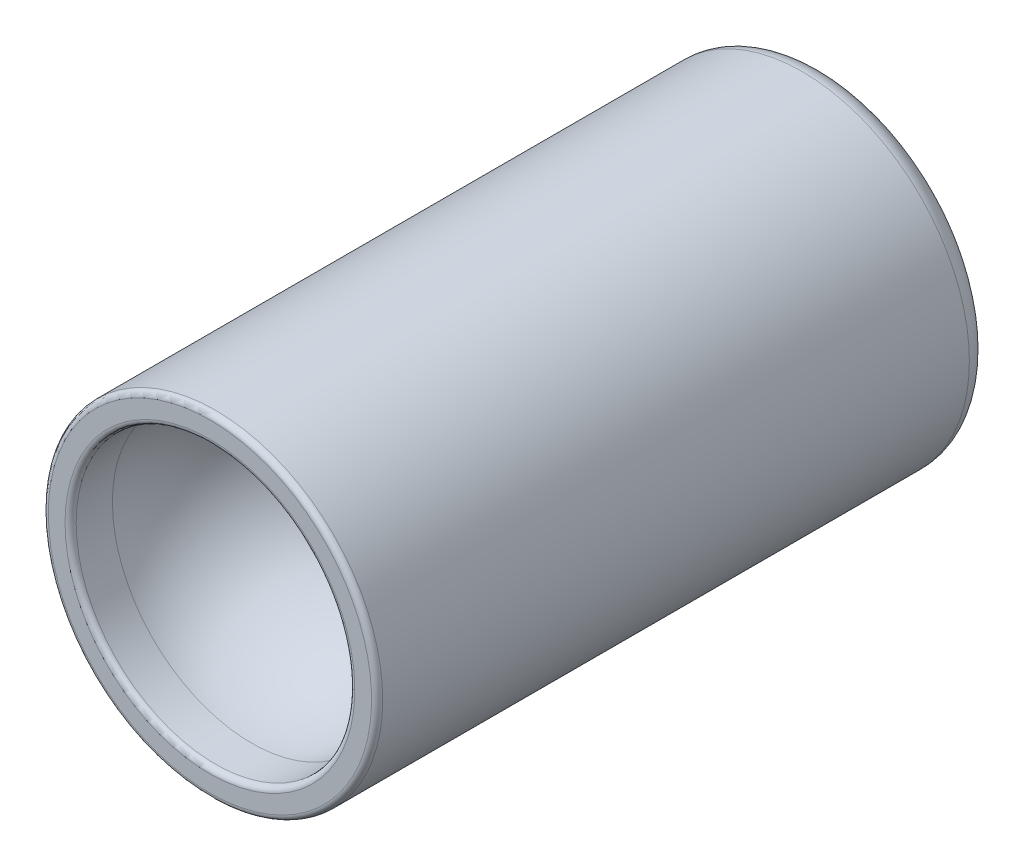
ISO-10303-21;
HEADER;
FILE_DESCRIPTION(('STEP AP214'),'2;1');
FILE_NAME('part.step','',(''),(''),'','','');
FILE_SCHEMA(('AUTOMOTIVE_DESIGN { 1 0 10303 214 1 1 1 1 }'));
ENDSEC;
DATA;
#1=APPLICATION_CONTEXT('core data for automotive mechanical design processes');
#2=APPLICATION_PROTOCOL_DEFINITION('international standard','automotive_design',2000,#1);
#3=PRODUCT_CONTEXT('',#1,'mechanical');
#4=PRODUCT('Part','Part','',(#3));
#5=PRODUCT_RELATED_PRODUCT_CATEGORY('part','',(#4));
#6=PRODUCT_DEFINITION_FORMATION('','',#4);
#7=PRODUCT_DEFINITION_CONTEXT('part definition',#1,'design');
#8=PRODUCT_DEFINITION('design','',#6,#7);
#9=PRODUCT_DEFINITION_SHAPE('','',#8);
#10=(LENGTH_UNIT() NAMED_UNIT(*) SI_UNIT(.MILLI.,.METRE.));
#11=(NAMED_UNIT(*) PLANE_ANGLE_UNIT() SI_UNIT($,.RADIAN.));
#12=(NAMED_UNIT(*) SI_UNIT($,.STERADIAN.) SOLID_ANGLE_UNIT());
#13=UNCERTAINTY_MEASURE_WITH_UNIT(LENGTH_MEASURE(1.E-05),#10,'distance_accuracy_value','');
#14=(GEOMETRIC_REPRESENTATION_CONTEXT(3) GLOBAL_UNCERTAINTY_ASSIGNED_CONTEXT((#13)) GLOBAL_UNIT_ASSIGNED_CONTEXT((#10,
#11,#12)) REPRESENTATION_CONTEXT('',''));
#15=CARTESIAN_POINT('',(0.,0.,0.));
#16=DIRECTION('',(0.,0.,1.));
#17=DIRECTION('',(1.,0.,0.));
#18=AXIS2_PLACEMENT_3D('',#15,#16,#17);
#19=CARTESIAN_POINT('',(0.,6.,0.));
#20=DIRECTION('',(0.,0.,-1.));
#21=DIRECTION('',(-1.,0.,0.));
#22=AXIS2_PLACEMENT_3D('',#19,#20,#21);
#23=PLANE('',#22);
#24=CARTESIAN_POINT('',(0.,0.,0.));
#25=DIRECTION('',(0.,0.,-1.));
#26=DIRECTION('',(-1.,0.,0.));
#27=AXIS2_PLACEMENT_3D('',#24,#25,#26);
#28=CIRCLE('',#27,5.2);
#29=CARTESIAN_POINT('',(-5.2,0.,0.));
#30=VERTEX_POINT('',#29);
#31=EDGE_CURVE('E43',#30,#30,#28,.T.);
#32=ORIENTED_EDGE('',*,*,#31,.T.);
#33=EDGE_LOOP('',(#32));
#34=FACE_BOUND('',#33,.T.);
#35=CARTESIAN_POINT('',(0.,0.,0.));
#36=DIRECTION('',(0.,0.,-1.));
#37=DIRECTION('',(-1.,0.,0.));
#38=AXIS2_PLACEMENT_3D('',#35,#36,#37);
#39=CIRCLE('',#38,5.8);
#40=CARTESIAN_POINT('',(-5.8,0.,0.));
#41=VERTEX_POINT('',#40);
#42=EDGE_CURVE('E46',#41,#41,#39,.F.);
#43=ORIENTED_EDGE('',*,*,#42,.T.);
#44=EDGE_LOOP('',(#43));
#45=FACE_BOUND('',#44,.T.);
#46=ADVANCED_FACE('F24',(#34,#45),#23,.F.);
#47=CARTESIAN_POINT('',(0.,0.,0.));
#48=DIRECTION('',(0.,0.,1.));
#49=DIRECTION('',(1.,0.,0.));
#50=AXIS2_PLACEMENT_3D('',#47,#48,#49);
#51=CYLINDRICAL_SURFACE('',#50,5.);
#52=CARTESIAN_POINT('',(0.,0.,-0.2));
#53=DIRECTION('',(0.,0.,-1.));
#54=DIRECTION('',(-1.,0.,0.));
#55=AXIS2_PLACEMENT_3D('',#52,#53,#54);
#56=CIRCLE('',#55,5.);
#57=CARTESIAN_POINT('',(-5.,0.,-0.2));
#58=VERTEX_POINT('',#57);
#59=EDGE_CURVE('E49',#58,#58,#56,.F.);
#60=ORIENTED_EDGE('',*,*,#59,.T.);
#61=EDGE_LOOP('',(#60));
#62=FACE_BOUND('',#61,.T.);
#63=CARTESIAN_POINT('',(0.,0.,-1.5));
#64=DIRECTION('',(0.,0.,1.));
#65=DIRECTION('',(1.,0.,0.));
#66=AXIS2_PLACEMENT_3D('',#63,#64,#65);
#67=CIRCLE('',#66,5.);
#68=CARTESIAN_POINT('',(5.,0.,-1.5));
#69=VERTEX_POINT('',#68);
#70=EDGE_CURVE('E61',#69,#69,#67,.T.);
#71=ORIENTED_EDGE('',*,*,#70,.F.);
#72=EDGE_LOOP('',(#71));
#73=FACE_BOUND('',#72,.T.);
#74=ADVANCED_FACE('F94',(#62,#73),#51,.F.);
#75=CARTESIAN_POINT('',(0.,0.,-1.5));
#76=DIRECTION('',(0.,0.,1.));
#77=DIRECTION('',(0.,1.,0.));
#78=AXIS2_PLACEMENT_3D('',#75,#76,#77);
#79=SPHERICAL_SURFACE('',#78,5.);
#80=CARTESIAN_POINT('',(0.,0.,-5.61752954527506));
#81=DIRECTION('',(0.,0.,1.));
#82=DIRECTION('',(1.,0.,0.));
#83=AXIS2_PLACEMENT_3D('',#80,#81,#82);
#84=CIRCLE('',#83,2.83653846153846);
#85=CARTESIAN_POINT('',(2.83653846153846,0.,-5.61752954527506));
#86=VERTEX_POINT('',#85);
#87=EDGE_CURVE('E52',#86,#86,#84,.F.);
#88=ORIENTED_EDGE('',*,*,#87,.T.);
#89=EDGE_LOOP('',(#88));
#90=FACE_BOUND('',#89,.T.);
#91=ORIENTED_EDGE('',*,*,#70,.T.);
#92=EDGE_LOOP('',(#91));
#93=FACE_BOUND('',#92,.T.);
#94=ADVANCED_FACE('F99',(#90,#93),#79,.F.);
#95=CARTESIAN_POINT('',(0.,0.,0.));
#96=DIRECTION('',(0.,0.,1.));
#97=DIRECTION('',(1.,0.,0.));
#98=AXIS2_PLACEMENT_3D('',#95,#96,#97);
#99=CYLINDRICAL_SURFACE('',#98,2.75);
#100=CARTESIAN_POINT('',(0.,0.,-5.78223072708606));
#101=DIRECTION('',(0.,0.,1.));
#102=DIRECTION('',(1.,0.,0.));
#103=AXIS2_PLACEMENT_3D('',#100,#101,#102);
#104=CIRCLE('',#103,2.75);
#105=CARTESIAN_POINT('',(2.75,0.,-5.78223072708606));
#106=VERTEX_POINT('',#105);
#107=EDGE_CURVE('E55',#106,#106,#104,.T.);
#108=ORIENTED_EDGE('',*,*,#107,.T.);
#109=EDGE_LOOP('',(#108));
#110=FACE_BOUND('',#109,.T.);
#111=CARTESIAN_POINT('',(0.,0.,-12.2177692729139));
#112=DIRECTION('',(0.,0.,-1.));
#113=DIRECTION('',(-1.,0.,0.));
#114=AXIS2_PLACEMENT_3D('',#111,#112,#113);
#115=CIRCLE('',#114,2.75);
#116=CARTESIAN_POINT('',(-2.75,0.,-12.2177692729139));
#117=VERTEX_POINT('',#116);
#118=EDGE_CURVE('E58',#117,#117,#115,.T.);
#119=ORIENTED_EDGE('',*,*,#118,.T.);
#120=EDGE_LOOP('',(#119));
#121=FACE_BOUND('',#120,.T.);
#122=ADVANCED_FACE('F165',(#110,#121),#99,.F.);
#123=CARTESIAN_POINT('',(0.,0.,-16.5));
#124=DIRECTION('',(0.,0.,1.));
#125=DIRECTION('',(0.,1.,0.));
#126=AXIS2_PLACEMENT_3D('',#123,#124,#125);
#127=SPHERICAL_SURFACE('',#126,5.);
#128=CARTESIAN_POINT('',(0.,0.,-12.3824704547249));
#129=DIRECTION('',(0.,0.,-1.));
#130=DIRECTION('',(-1.,0.,0.));
#131=AXIS2_PLACEMENT_3D('',#128,#129,#130);
#132=CIRCLE('',#131,2.83653846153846);
#133=CARTESIAN_POINT('',(-2.83653846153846,0.,-12.3824704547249));
#134=VERTEX_POINT('',#133);
#135=EDGE_CURVE('E38',#134,#134,#132,.F.);
#136=ORIENTED_EDGE('',*,*,#135,.T.);
#137=EDGE_LOOP('',(#136));
#138=FACE_BOUND('',#137,.T.);
#139=CARTESIAN_POINT('',(0.,0.,-16.5));
#140=DIRECTION('',(0.,0.,1.));
#141=DIRECTION('',(1.,0.,0.));
#142=AXIS2_PLACEMENT_3D('',#139,#140,#141);
#143=CIRCLE('',#142,5.);
#144=CARTESIAN_POINT('',(5.,0.,-16.5));
#145=VERTEX_POINT('',#144);
#146=EDGE_CURVE('E64',#145,#145,#143,.T.);
#147=ORIENTED_EDGE('',*,*,#146,.F.);
#148=EDGE_LOOP('',(#147));
#149=FACE_BOUND('',#148,.T.);
#150=ADVANCED_FACE('F91',(#138,#149),#127,.F.);
#151=CARTESIAN_POINT('',(0.,0.,0.));
#152=DIRECTION('',(0.,0.,1.));
#153=DIRECTION('',(1.,0.,0.));
#154=AXIS2_PLACEMENT_3D('',#151,#152,#153);
#155=CYLINDRICAL_SURFACE('',#154,5.);
#156=CARTESIAN_POINT('',(0.,0.,-21.8));
#157=DIRECTION('',(0.,0.,1.));
#158=DIRECTION('',(1.,0.,0.));
#159=AXIS2_PLACEMENT_3D('',#156,#157,#158);
#160=CIRCLE('',#159,5.);
#161=CARTESIAN_POINT('',(5.,0.,-21.8));
#162=VERTEX_POINT('',#161);
#163=EDGE_CURVE('E30',#162,#162,#160,.F.);
#164=ORIENTED_EDGE('',*,*,#163,.T.);
#165=EDGE_LOOP('',(#164));
#166=FACE_BOUND('',#165,.T.);
#167=ORIENTED_EDGE('',*,*,#146,.T.);
#168=EDGE_LOOP('',(#167));
#169=FACE_BOUND('',#168,.T.);
#170=ADVANCED_FACE('F84',(#166,#169),#155,.F.);
#171=CARTESIAN_POINT('',(0.,5.25,-22.));
#172=DIRECTION('',(0.,0.,1.));
#173=DIRECTION('',(1.,0.,0.));
#174=AXIS2_PLACEMENT_3D('',#171,#172,#173);
#175=PLANE('',#174);
#176=CARTESIAN_POINT('',(0.,0.,-22.));
#177=DIRECTION('',(0.,0.,1.));
#178=DIRECTION('',(1.,0.,0.));
#179=AXIS2_PLACEMENT_3D('',#176,#177,#178);
#180=CIRCLE('',#179,5.2);
#181=CARTESIAN_POINT('',(5.2,0.,-22.));
#182=VERTEX_POINT('',#181);
#183=EDGE_CURVE('E34',#182,#182,#180,.T.);
#184=ORIENTED_EDGE('',*,*,#183,.T.);
#185=EDGE_LOOP('',(#184));
#186=FACE_BOUND('',#185,.T.);
#187=CARTESIAN_POINT('',(0.,0.,-22.));
#188=DIRECTION('',(0.,0.,1.));
#189=DIRECTION('',(1.,0.,0.));
#190=AXIS2_PLACEMENT_3D('',#187,#188,#189);
#191=CIRCLE('',#190,5.25);
#192=CARTESIAN_POINT('',(5.25,0.,-22.));
#193=VERTEX_POINT('',#192);
#194=EDGE_CURVE('E67',#193,#193,#191,.T.);
#195=ORIENTED_EDGE('',*,*,#194,.F.);
#196=EDGE_LOOP('',(#195));
#197=FACE_BOUND('',#196,.T.);
#198=ADVANCED_FACE('F79',(#186,#197),#175,.F.);
#199=CARTESIAN_POINT('',(0.,0.,-21.25));
#200=DIRECTION('',(0.,0.,1.));
#201=DIRECTION('',(1.,0.,0.));
#202=AXIS2_PLACEMENT_3D('',#199,#200,#201);
#203=TOROIDAL_SURFACE('',#202,5.25,0.75);
#204=CARTESIAN_POINT('',(0.,0.,-21.25));
#205=DIRECTION('',(0.,0.,1.));
#206=DIRECTION('',(1.,0.,0.));
#207=AXIS2_PLACEMENT_3D('',#204,#205,#206);
#208=CIRCLE('',#207,6.);
#209=CARTESIAN_POINT('',(6.,0.,-21.25));
#210=VERTEX_POINT('',#209);
#211=EDGE_CURVE('E70',#210,#210,#208,.T.);
#212=ORIENTED_EDGE('',*,*,#211,.F.);
#213=EDGE_LOOP('',(#212));
#214=FACE_BOUND('',#213,.T.);
#215=ORIENTED_EDGE('',*,*,#194,.T.);
#216=EDGE_LOOP('',(#215));
#217=FACE_BOUND('',#216,.T.);
#218=ADVANCED_FACE('F76',(#214,#217),#203,.T.);
#219=CARTESIAN_POINT('',(0.,0.,0.));
#220=DIRECTION('',(0.,0.,1.));
#221=DIRECTION('',(1.,0.,0.));
#222=AXIS2_PLACEMENT_3D('',#219,#220,#221);
#223=CYLINDRICAL_SURFACE('',#222,6.);
#224=CARTESIAN_POINT('',(0.,0.,-0.2));
#225=DIRECTION('',(0.,0.,-1.));
#226=DIRECTION('',(-1.,0.,0.));
#227=AXIS2_PLACEMENT_3D('',#224,#225,#226);
#228=CIRCLE('',#227,6.);
#229=CARTESIAN_POINT('',(-6.,0.,-0.2));
#230=VERTEX_POINT('',#229);
#231=EDGE_CURVE('E10',#230,#230,#228,.T.);
#232=ORIENTED_EDGE('',*,*,#231,.T.);
#233=EDGE_LOOP('',(#232));
#234=FACE_BOUND('',#233,.T.);
#235=ORIENTED_EDGE('',*,*,#211,.T.);
#236=EDGE_LOOP('',(#235));
#237=FACE_BOUND('',#236,.T.);
#238=ADVANCED_FACE('F74',(#234,#237),#223,.T.);
#239=CARTESIAN_POINT('',(0.,0.,-5.78223072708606));
#240=DIRECTION('',(0.,0.,1.));
#241=DIRECTION('',(1.,0.,0.));
#242=AXIS2_PLACEMENT_3D('',#239,#240,#241);
#243=TOROIDAL_SURFACE('',#242,2.95,0.2);
#244=ORIENTED_EDGE('',*,*,#87,.F.);
#245=EDGE_LOOP('',(#244));
#246=FACE_BOUND('',#245,.T.);
#247=ORIENTED_EDGE('',*,*,#107,.F.);
#248=EDGE_LOOP('',(#247));
#249=FACE_BOUND('',#248,.T.);
#250=ADVANCED_FACE('F123',(#246,#249),#243,.T.);
#251=CARTESIAN_POINT('',(0.,0.,-0.2));
#252=DIRECTION('',(0.,0.,-1.));
#253=DIRECTION('',(-1.,0.,0.));
#254=AXIS2_PLACEMENT_3D('',#251,#252,#253);
#255=TOROIDAL_SURFACE('',#254,5.2,0.2);
#256=ORIENTED_EDGE('',*,*,#31,.F.);
#257=EDGE_LOOP('',(#256));
#258=FACE_BOUND('',#257,.T.);
#259=ORIENTED_EDGE('',*,*,#59,.F.);
#260=EDGE_LOOP('',(#259));
#261=FACE_BOUND('',#260,.T.);
#262=ADVANCED_FACE('F119',(#258,#261),#255,.T.);
#263=CARTESIAN_POINT('',(0.,0.,-12.2177692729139));
#264=DIRECTION('',(0.,0.,-1.));
#265=DIRECTION('',(-1.,0.,0.));
#266=AXIS2_PLACEMENT_3D('',#263,#264,#265);
#267=TOROIDAL_SURFACE('',#266,2.95,0.2);
#268=ORIENTED_EDGE('',*,*,#118,.F.);
#269=EDGE_LOOP('',(#268));
#270=FACE_BOUND('',#269,.T.);
#271=ORIENTED_EDGE('',*,*,#135,.F.);
#272=EDGE_LOOP('',(#271));
#273=FACE_BOUND('',#272,.T.);
#274=ADVANCED_FACE('F113',(#270,#273),#267,.T.);
#275=CARTESIAN_POINT('',(0.,0.,-21.8));
#276=DIRECTION('',(0.,0.,1.));
#277=DIRECTION('',(1.,0.,0.));
#278=AXIS2_PLACEMENT_3D('',#275,#276,#277);
#279=TOROIDAL_SURFACE('',#278,5.2,0.2);
#280=ORIENTED_EDGE('',*,*,#163,.F.);
#281=EDGE_LOOP('',(#280));
#282=FACE_BOUND('',#281,.T.);
#283=ORIENTED_EDGE('',*,*,#183,.F.);
#284=EDGE_LOOP('',(#283));
#285=FACE_BOUND('',#284,.T.);
#286=ADVANCED_FACE('F107',(#282,#285),#279,.T.);
#287=CARTESIAN_POINT('',(0.,0.,-0.2));
#288=DIRECTION('',(0.,0.,-1.));
#289=DIRECTION('',(-1.,0.,0.));
#290=AXIS2_PLACEMENT_3D('',#287,#288,#289);
#291=TOROIDAL_SURFACE('',#290,5.8,0.2);
#292=ORIENTED_EDGE('',*,*,#231,.F.);
#293=EDGE_LOOP('',(#292));
#294=FACE_BOUND('',#293,.T.);
#295=ORIENTED_EDGE('',*,*,#42,.F.);
#296=EDGE_LOOP('',(#295));
#297=FACE_BOUND('',#296,.T.);
#298=ADVANCED_FACE('F105',(#294,#297),#291,.T.);
#299=CLOSED_SHELL('',(#46,#74,#94,#122,#150,#170,#198,#218,#238,#250,#262,#274,#286,#298));
#300=MANIFOLD_SOLID_BREP('B2',#299);
#301=ADVANCED_BREP_SHAPE_REPRESENTATION('',(#18,#300),#14);
#302=SHAPE_DEFINITION_REPRESENTATION(#9,#301);
ENDSEC;
END-ISO-10303-21;
